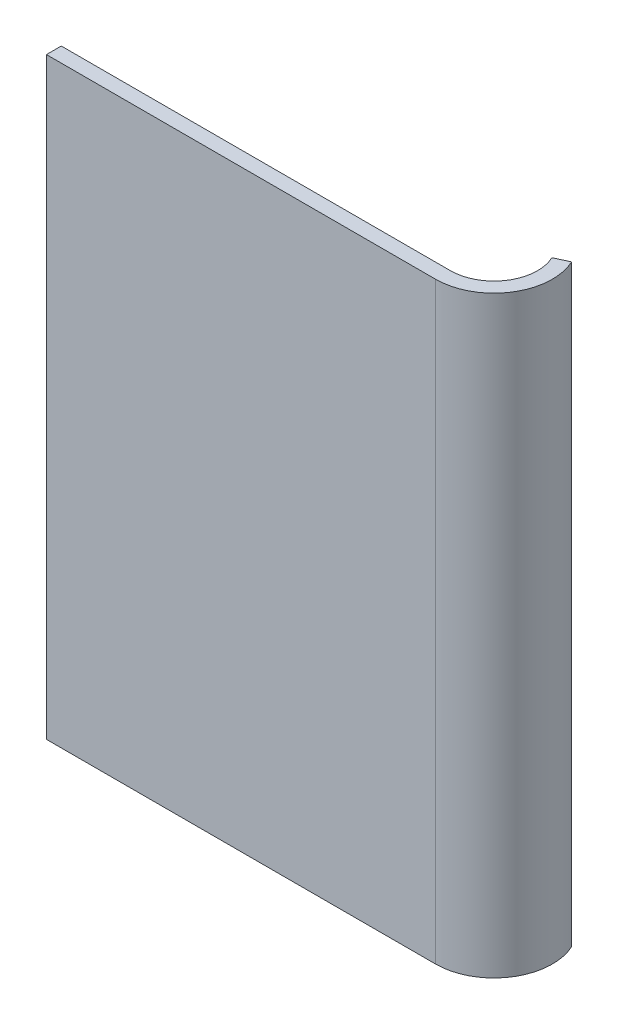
ISO-10303-21;
HEADER;
FILE_DESCRIPTION(('STEP AP214'),'2;1');
FILE_NAME('part.step','',(''),(''),'','','');
FILE_SCHEMA(('AUTOMOTIVE_DESIGN { 1 0 10303 214 1 1 1 1 }'));
ENDSEC;
DATA;
#1=APPLICATION_CONTEXT('core data for automotive mechanical design processes');
#2=APPLICATION_PROTOCOL_DEFINITION('international standard','automotive_design',2000,#1);
#3=PRODUCT_CONTEXT('',#1,'mechanical');
#4=PRODUCT('Part','Part','',(#3));
#5=PRODUCT_RELATED_PRODUCT_CATEGORY('part','',(#4));
#6=PRODUCT_DEFINITION_FORMATION('','',#4);
#7=PRODUCT_DEFINITION_CONTEXT('part definition',#1,'design');
#8=PRODUCT_DEFINITION('design','',#6,#7);
#9=PRODUCT_DEFINITION_SHAPE('','',#8);
#10=(LENGTH_UNIT() NAMED_UNIT(*) SI_UNIT(.MILLI.,.METRE.));
#11=(NAMED_UNIT(*) PLANE_ANGLE_UNIT() SI_UNIT($,.RADIAN.));
#12=(NAMED_UNIT(*) SI_UNIT($,.STERADIAN.) SOLID_ANGLE_UNIT());
#13=UNCERTAINTY_MEASURE_WITH_UNIT(LENGTH_MEASURE(1.E-05),#10,'distance_accuracy_value','');
#14=(GEOMETRIC_REPRESENTATION_CONTEXT(3) GLOBAL_UNCERTAINTY_ASSIGNED_CONTEXT((#13)) GLOBAL_UNIT_ASSIGNED_CONTEXT((#10,
#11,#12)) REPRESENTATION_CONTEXT('',''));
#15=CARTESIAN_POINT('',(0.,0.,0.));
#16=DIRECTION('',(0.,0.,1.));
#17=DIRECTION('',(1.,0.,0.));
#18=AXIS2_PLACEMENT_3D('',#15,#16,#17);
#19=CARTESIAN_POINT('',(0.,1524.,-38.1));
#20=DIRECTION('',(1.,0.,0.));
#21=DIRECTION('',(0.,0.,-1.));
#22=AXIS2_PLACEMENT_3D('',#19,#20,#21);
#23=PLANE('',#22);
#24=DIRECTION('',(0.,0.,1.));
#25=VECTOR('',#24,1.);
#26=CARTESIAN_POINT('',(0.,0.,-38.1));
#27=LINE('',#26,#25);
#28=CARTESIAN_POINT('',(0.,0.,-38.1));
#29=VERTEX_POINT('',#28);
#30=CARTESIAN_POINT('',(0.,0.,0.));
#31=VERTEX_POINT('',#30);
#32=EDGE_CURVE('E114',#29,#31,#27,.T.);
#33=ORIENTED_EDGE('',*,*,#32,.T.);
#34=DIRECTION('',(0.,-1.,0.));
#35=VECTOR('',#34,1.);
#36=CARTESIAN_POINT('',(0.,1524.,0.));
#37=LINE('',#36,#35);
#38=CARTESIAN_POINT('',(0.,1524.,0.));
#39=VERTEX_POINT('',#38);
#40=EDGE_CURVE('E11',#39,#31,#37,.T.);
#41=ORIENTED_EDGE('',*,*,#40,.F.);
#42=DIRECTION('',(0.,0.,1.));
#43=VECTOR('',#42,1.);
#44=CARTESIAN_POINT('',(0.,1524.,-38.1));
#45=LINE('',#44,#43);
#46=CARTESIAN_POINT('',(0.,1524.,-38.1));
#47=VERTEX_POINT('',#46);
#48=EDGE_CURVE('E124',#47,#39,#45,.T.);
#49=ORIENTED_EDGE('',*,*,#48,.F.);
#50=DIRECTION('',(0.,-1.,0.));
#51=VECTOR('',#50,1.);
#52=CARTESIAN_POINT('',(0.,1524.,-38.1));
#53=LINE('',#52,#51);
#54=EDGE_CURVE('E110',#47,#29,#53,.T.);
#55=ORIENTED_EDGE('',*,*,#54,.T.);
#56=EDGE_LOOP('',(#33,#41,#49,#55));
#57=FACE_BOUND('',#56,.T.);
#58=ADVANCED_FACE('F30',(#57),#23,.F.);
#59=CARTESIAN_POINT('',(0.,1524.,0.));
#60=DIRECTION('',(0.,0.,-1.));
#61=DIRECTION('',(-1.,0.,0.));
#62=AXIS2_PLACEMENT_3D('',#59,#60,#61);
#63=PLANE('',#62);
#64=DIRECTION('',(1.,0.,0.));
#65=VECTOR('',#64,1.);
#66=CARTESIAN_POINT('',(0.,0.,0.));
#67=LINE('',#66,#65);
#68=CARTESIAN_POINT('',(1000.,0.,0.));
#69=VERTEX_POINT('',#68);
#70=EDGE_CURVE('E117',#31,#69,#67,.T.);
#71=ORIENTED_EDGE('',*,*,#70,.T.);
#72=DIRECTION('',(0.,-1.,0.));
#73=VECTOR('',#72,1.);
#74=CARTESIAN_POINT('',(1000.,1524.,0.));
#75=LINE('',#74,#73);
#76=CARTESIAN_POINT('',(1000.,1524.,0.));
#77=VERTEX_POINT('',#76);
#78=EDGE_CURVE('E38',#77,#69,#75,.T.);
#79=ORIENTED_EDGE('',*,*,#78,.F.);
#80=DIRECTION('',(1.,0.,0.));
#81=VECTOR('',#80,1.);
#82=CARTESIAN_POINT('',(0.,1524.,0.));
#83=LINE('',#82,#81);
#84=EDGE_CURVE('E83',#39,#77,#83,.T.);
#85=ORIENTED_EDGE('',*,*,#84,.F.);
#86=ORIENTED_EDGE('',*,*,#40,.T.);
#87=EDGE_LOOP('',(#71,#79,#85,#86));
#88=FACE_BOUND('',#87,.T.);
#89=ADVANCED_FACE('F148',(#88),#63,.F.);
#90=CARTESIAN_POINT('',(1000.,1524.,-150.));
#91=DIRECTION('',(0.,-1.,0.));
#92=DIRECTION('',(0.,0.,-1.));
#93=AXIS2_PLACEMENT_3D('',#90,#91,#92);
#94=CYLINDRICAL_SURFACE('',#93,150.);
#95=CARTESIAN_POINT('',(1000.,0.,-150.));
#96=DIRECTION('',(0.,1.,0.));
#97=DIRECTION('',(0.,0.,1.));
#98=AXIS2_PLACEMENT_3D('',#95,#96,#97);
#99=CIRCLE('',#98,150.);
#100=CARTESIAN_POINT('',(1135.9461680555,0.,-213.392739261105));
#101=VERTEX_POINT('',#100);
#102=EDGE_CURVE('E119',#69,#101,#99,.T.);
#103=ORIENTED_EDGE('',*,*,#102,.T.);
#104=DIRECTION('',(0.,-1.,0.));
#105=VECTOR('',#104,1.);
#106=CARTESIAN_POINT('',(1135.9461680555,1524.,-213.392739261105));
#107=LINE('',#106,#105);
#108=CARTESIAN_POINT('',(1135.9461680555,1524.,-213.392739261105));
#109=VERTEX_POINT('',#108);
#110=EDGE_CURVE('E105',#109,#101,#107,.T.);
#111=ORIENTED_EDGE('',*,*,#110,.F.);
#112=CARTESIAN_POINT('',(1000.,1524.,-150.));
#113=DIRECTION('',(0.,1.,0.));
#114=DIRECTION('',(0.,0.,1.));
#115=AXIS2_PLACEMENT_3D('',#112,#113,#114);
#116=CIRCLE('',#115,150.);
#117=EDGE_CURVE('E96',#77,#109,#116,.T.);
#118=ORIENTED_EDGE('',*,*,#117,.F.);
#119=ORIENTED_EDGE('',*,*,#78,.T.);
#120=EDGE_LOOP('',(#103,#111,#118,#119));
#121=FACE_BOUND('',#120,.T.);
#122=ADVANCED_FACE('F130',(#121),#94,.T.);
#123=CARTESIAN_POINT('',(1101.4158413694,1524.,-197.290983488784));
#124=DIRECTION('',(0.4226182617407,0.,0.90630778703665));
#125=DIRECTION('',(0.90630778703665,0.,-0.4226182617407));
#126=AXIS2_PLACEMENT_3D('',#123,#124,#125);
#127=PLANE('',#126);
#128=DIRECTION('',(-0.90630778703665,0.,0.4226182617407));
#129=VECTOR('',#128,1.);
#130=CARTESIAN_POINT('',(1101.4158413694,0.,-197.290983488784));
#131=LINE('',#130,#129);
#132=CARTESIAN_POINT('',(1101.4158413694,0.,-197.290983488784));
#133=VERTEX_POINT('',#132);
#134=EDGE_CURVE('E104',#101,#133,#131,.T.);
#135=ORIENTED_EDGE('',*,*,#134,.T.);
#136=DIRECTION('',(0.,-1.,0.));
#137=VECTOR('',#136,1.);
#138=CARTESIAN_POINT('',(1101.4158413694,1524.,-197.290983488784));
#139=LINE('',#138,#137);
#140=CARTESIAN_POINT('',(1101.4158413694,1524.,-197.290983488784));
#141=VERTEX_POINT('',#140);
#142=EDGE_CURVE('E101',#141,#133,#139,.T.);
#143=ORIENTED_EDGE('',*,*,#142,.F.);
#144=DIRECTION('',(-0.90630778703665,0.,0.4226182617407));
#145=VECTOR('',#144,1.);
#146=CARTESIAN_POINT('',(1101.4158413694,1524.,-197.290983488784));
#147=LINE('',#146,#145);
#148=EDGE_CURVE('E90',#109,#141,#147,.T.);
#149=ORIENTED_EDGE('',*,*,#148,.F.);
#150=ORIENTED_EDGE('',*,*,#110,.T.);
#151=EDGE_LOOP('',(#135,#143,#149,#150));
#152=FACE_BOUND('',#151,.T.);
#153=ADVANCED_FACE('F102',(#152),#127,.F.);
#154=CARTESIAN_POINT('',(1000.,1524.,-150.));
#155=DIRECTION('',(0.,-1.,0.));
#156=DIRECTION('',(0.,0.,-1.));
#157=AXIS2_PLACEMENT_3D('',#154,#155,#156);
#158=CYLINDRICAL_SURFACE('',#157,111.9);
#159=CARTESIAN_POINT('',(1000.,0.,-150.));
#160=DIRECTION('',(0.,-1.,0.));
#161=DIRECTION('',(0.,0.,1.));
#162=AXIS2_PLACEMENT_3D('',#159,#160,#161);
#163=CIRCLE('',#162,111.9);
#164=CARTESIAN_POINT('',(1000.,0.,-38.1));
#165=VERTEX_POINT('',#164);
#166=EDGE_CURVE('E69',#133,#165,#163,.T.);
#167=ORIENTED_EDGE('',*,*,#166,.T.);
#168=DIRECTION('',(0.,-1.,0.));
#169=VECTOR('',#168,1.);
#170=CARTESIAN_POINT('',(1000.,1524.,-38.1));
#171=LINE('',#170,#169);
#172=CARTESIAN_POINT('',(1000.,1524.,-38.1));
#173=VERTEX_POINT('',#172);
#174=EDGE_CURVE('E106',#173,#165,#171,.T.);
#175=ORIENTED_EDGE('',*,*,#174,.F.);
#176=CARTESIAN_POINT('',(1000.,1524.,-150.));
#177=DIRECTION('',(0.,-1.,0.));
#178=DIRECTION('',(0.,0.,1.));
#179=AXIS2_PLACEMENT_3D('',#176,#177,#178);
#180=CIRCLE('',#179,111.9);
#181=EDGE_CURVE('E94',#141,#173,#180,.T.);
#182=ORIENTED_EDGE('',*,*,#181,.F.);
#183=ORIENTED_EDGE('',*,*,#142,.T.);
#184=EDGE_LOOP('',(#167,#175,#182,#183));
#185=FACE_BOUND('',#184,.T.);
#186=ADVANCED_FACE('F108',(#185),#158,.F.);
#187=CARTESIAN_POINT('',(0.,1524.,-38.1));
#188=DIRECTION('',(0.,0.,1.));
#189=DIRECTION('',(1.,0.,0.));
#190=AXIS2_PLACEMENT_3D('',#187,#188,#189);
#191=PLANE('',#190);
#192=DIRECTION('',(-1.,0.,0.));
#193=VECTOR('',#192,1.);
#194=CARTESIAN_POINT('',(0.,0.,-38.1));
#195=LINE('',#194,#193);
#196=EDGE_CURVE('E75',#165,#29,#195,.T.);
#197=ORIENTED_EDGE('',*,*,#196,.T.);
#198=ORIENTED_EDGE('',*,*,#54,.F.);
#199=DIRECTION('',(-1.,0.,0.));
#200=VECTOR('',#199,1.);
#201=CARTESIAN_POINT('',(0.,1524.,-38.1));
#202=LINE('',#201,#200);
#203=EDGE_CURVE('E46',#173,#47,#202,.T.);
#204=ORIENTED_EDGE('',*,*,#203,.F.);
#205=ORIENTED_EDGE('',*,*,#174,.T.);
#206=EDGE_LOOP('',(#197,#198,#204,#205));
#207=FACE_BOUND('',#206,.T.);
#208=ADVANCED_FACE('F137',(#207),#191,.F.);
#209=CARTESIAN_POINT('',(1000.,1524.,-150.));
#210=DIRECTION('',(0.,1.,0.));
#211=DIRECTION('',(0.,0.,1.));
#212=AXIS2_PLACEMENT_3D('',#209,#210,#211);
#213=PLANE('',#212);
#214=ORIENTED_EDGE('',*,*,#48,.T.);
#215=ORIENTED_EDGE('',*,*,#84,.T.);
#216=ORIENTED_EDGE('',*,*,#117,.T.);
#217=ORIENTED_EDGE('',*,*,#148,.T.);
#218=ORIENTED_EDGE('',*,*,#181,.T.);
#219=ORIENTED_EDGE('',*,*,#203,.T.);
#220=EDGE_LOOP('',(#214,#215,#216,#217,#218,#219));
#221=FACE_BOUND('',#220,.T.);
#222=ADVANCED_FACE('F92',(#221),#213,.T.);
#223=CARTESIAN_POINT('',(1000.,0.,-150.));
#224=DIRECTION('',(0.,1.,0.));
#225=DIRECTION('',(0.,0.,1.));
#226=AXIS2_PLACEMENT_3D('',#223,#224,#225);
#227=PLANE('',#226);
#228=ORIENTED_EDGE('',*,*,#32,.F.);
#229=ORIENTED_EDGE('',*,*,#196,.F.);
#230=ORIENTED_EDGE('',*,*,#166,.F.);
#231=ORIENTED_EDGE('',*,*,#134,.F.);
#232=ORIENTED_EDGE('',*,*,#102,.F.);
#233=ORIENTED_EDGE('',*,*,#70,.F.);
#234=EDGE_LOOP('',(#228,#229,#230,#231,#232,#233));
#235=FACE_BOUND('',#234,.T.);
#236=ADVANCED_FACE('F133',(#235),#227,.F.);
#237=CLOSED_SHELL('',(#58,#89,#122,#153,#186,#208,#222,#236));
#238=MANIFOLD_SOLID_BREP('B2',#237);
#239=ADVANCED_BREP_SHAPE_REPRESENTATION('',(#18,#238),#14);
#240=SHAPE_DEFINITION_REPRESENTATION(#9,#239);
ENDSEC;
END-ISO-10303-21;
